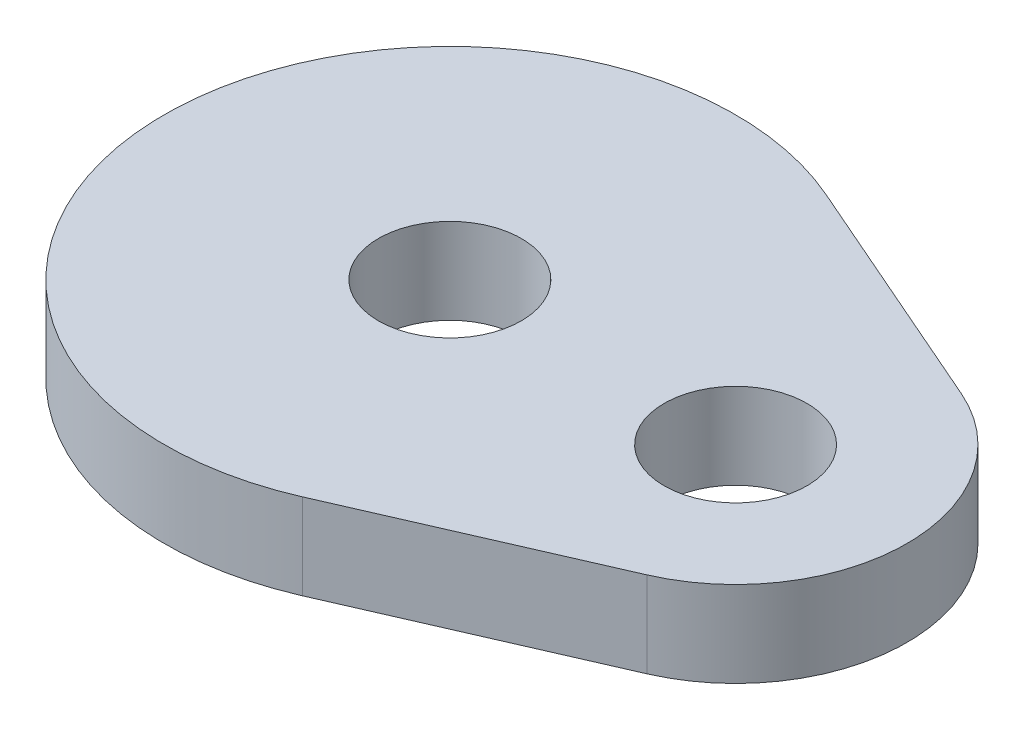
from build123d import *

# Parameters (mm, degrees)
SKETCH1_R      = 2.5
EXTRUDE1_DEPTH = 3


with BuildPart() as part:
    # Sketch1 → Extrude1 (new body)
    with BuildSketch(Plane(origin=(0, 0, 0), x_dir=(1, 0, 0), z_dir=(0, 1, 0))):
        with BuildLine():
            Line((4, 9.16515139), (12.4, 5.499090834))
            ThreePointArc((12.4, 5.499090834), (16, 0), (12.4, -5.499090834))
            Line((12.4, -5.499090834), (4, -9.16515139))
            ThreePointArc((4, -9.16515139), (-10, 0), (4, 9.16515139))
        make_face()
        with Locations(Location((0, 0, 0), (0, 0, 270))):
            Circle(SKETCH1_R, mode=Mode.SUBTRACT)
        with Locations(Location((10, 0, 0), (0, 0, 270))):
            Circle(SKETCH1_R, mode=Mode.SUBTRACT)
    extrude(amount=EXTRUDE1_DEPTH)


solid = part.part
